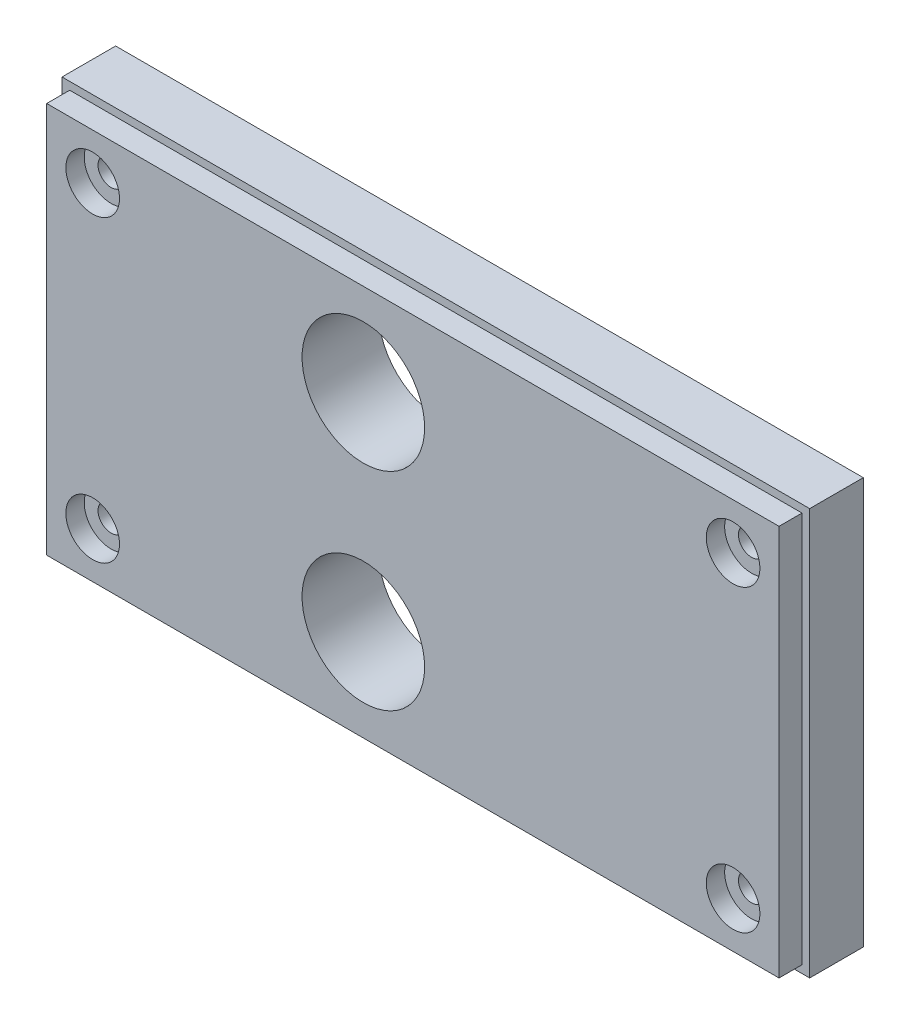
ISO-10303-21;
HEADER;
FILE_DESCRIPTION(('STEP AP214'),'2;1');
FILE_NAME('part.step','',(''),(''),'','','');
FILE_SCHEMA(('AUTOMOTIVE_DESIGN { 1 0 10303 214 1 1 1 1 }'));
ENDSEC;
DATA;
#1=APPLICATION_CONTEXT('core data for automotive mechanical design processes');
#2=APPLICATION_PROTOCOL_DEFINITION('international standard','automotive_design',2000,#1);
#3=PRODUCT_CONTEXT('',#1,'mechanical');
#4=PRODUCT('Part','Part','',(#3));
#5=PRODUCT_RELATED_PRODUCT_CATEGORY('part','',(#4));
#6=PRODUCT_DEFINITION_FORMATION('','',#4);
#7=PRODUCT_DEFINITION_CONTEXT('part definition',#1,'design');
#8=PRODUCT_DEFINITION('design','',#6,#7);
#9=PRODUCT_DEFINITION_SHAPE('','',#8);
#10=(LENGTH_UNIT() NAMED_UNIT(*) SI_UNIT(.MILLI.,.METRE.));
#11=(NAMED_UNIT(*) PLANE_ANGLE_UNIT() SI_UNIT($,.RADIAN.));
#12=(NAMED_UNIT(*) SI_UNIT($,.STERADIAN.) SOLID_ANGLE_UNIT());
#13=UNCERTAINTY_MEASURE_WITH_UNIT(LENGTH_MEASURE(1.E-05),#10,'distance_accuracy_value','');
#14=(GEOMETRIC_REPRESENTATION_CONTEXT(3) GLOBAL_UNCERTAINTY_ASSIGNED_CONTEXT((#13)) GLOBAL_UNIT_ASSIGNED_CONTEXT((#10,
#11,#12)) REPRESENTATION_CONTEXT('',''));
#15=CARTESIAN_POINT('',(0.,0.,0.));
#16=DIRECTION('',(0.,0.,1.));
#17=DIRECTION('',(1.,0.,0.));
#18=AXIS2_PLACEMENT_3D('',#15,#16,#17);
#19=CARTESIAN_POINT('',(0.,0.,7.));
#20=DIRECTION('',(0.,0.,1.));
#21=DIRECTION('',(1.,0.,0.));
#22=AXIS2_PLACEMENT_3D('',#19,#20,#21);
#23=PLANE('',#22);
#24=DIRECTION('',(0.,1.,0.));
#25=VECTOR('',#24,1.);
#26=CARTESIAN_POINT('',(130.,-76.5358983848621,7.));
#27=LINE('',#26,#25);
#28=CARTESIAN_POINT('',(130.,-76.5358983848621,7.));
#29=VERTEX_POINT('',#28);
#30=CARTESIAN_POINT('',(130.,-23.4641016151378,7.));
#31=VERTEX_POINT('',#30);
#32=EDGE_CURVE('E140',#29,#31,#27,.T.);
#33=ORIENTED_EDGE('',*,*,#32,.T.);
#34=DIRECTION('',(-1.,0.,0.));
#35=VECTOR('',#34,1.);
#36=CARTESIAN_POINT('',(130.,-23.4641016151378,7.));
#37=LINE('',#36,#35);
#38=CARTESIAN_POINT('',(32.3904332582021,-23.4641016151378,7.));
#39=VERTEX_POINT('',#38);
#40=EDGE_CURVE('E85',#31,#39,#37,.T.);
#41=ORIENTED_EDGE('',*,*,#40,.T.);
#42=DIRECTION('',(0.,-1.,0.));
#43=VECTOR('',#42,1.);
#44=CARTESIAN_POINT('',(32.3904332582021,-76.5358983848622,7.));
#45=LINE('',#44,#43);
#46=CARTESIAN_POINT('',(32.3904332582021,-76.5358983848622,7.));
#47=VERTEX_POINT('',#46);
#48=EDGE_CURVE('E143',#39,#47,#45,.T.);
#49=ORIENTED_EDGE('',*,*,#48,.T.);
#50=DIRECTION('',(1.,0.,0.));
#51=VECTOR('',#50,1.);
#52=CARTESIAN_POINT('',(130.,-76.5358983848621,7.));
#53=LINE('',#52,#51);
#54=EDGE_CURVE('E57',#47,#29,#53,.T.);
#55=ORIENTED_EDGE('',*,*,#54,.T.);
#56=EDGE_LOOP('',(#33,#41,#49,#55));
#57=FACE_BOUND('',#56,.T.);
#58=DIRECTION('',(1.,0.,0.));
#59=VECTOR('',#58,1.);
#60=CARTESIAN_POINT('',(33.3904332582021,-75.5358983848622,7.));
#61=LINE('',#60,#59);
#62=CARTESIAN_POINT('',(33.3904332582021,-75.5358983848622,7.));
#63=VERTEX_POINT('',#62);
#64=CARTESIAN_POINT('',(129.,-75.5358983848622,7.));
#65=VERTEX_POINT('',#64);
#66=EDGE_CURVE('E322',#63,#65,#61,.T.);
#67=ORIENTED_EDGE('',*,*,#66,.F.);
#68=DIRECTION('',(0.,-1.,0.));
#69=VECTOR('',#68,1.);
#70=CARTESIAN_POINT('',(33.3904332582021,-24.4641016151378,7.));
#71=LINE('',#70,#69);
#72=CARTESIAN_POINT('',(33.3904332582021,-24.4641016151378,7.));
#73=VERTEX_POINT('',#72);
#74=EDGE_CURVE('E130',#73,#63,#71,.T.);
#75=ORIENTED_EDGE('',*,*,#74,.F.);
#76=DIRECTION('',(-1.,0.,0.));
#77=VECTOR('',#76,1.);
#78=CARTESIAN_POINT('',(33.3904332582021,-24.4641016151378,7.));
#79=LINE('',#78,#77);
#80=CARTESIAN_POINT('',(129.,-24.4641016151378,7.));
#81=VERTEX_POINT('',#80);
#82=EDGE_CURVE('E126',#81,#73,#79,.T.);
#83=ORIENTED_EDGE('',*,*,#82,.F.);
#84=DIRECTION('',(0.,1.,0.));
#85=VECTOR('',#84,1.);
#86=CARTESIAN_POINT('',(129.,-24.4641016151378,7.));
#87=LINE('',#86,#85);
#88=EDGE_CURVE('E324',#65,#81,#87,.T.);
#89=ORIENTED_EDGE('',*,*,#88,.F.);
#90=EDGE_LOOP('',(#67,#75,#83,#89));
#91=FACE_BOUND('',#90,.T.);
#92=ADVANCED_FACE('F33',(#57,#91),#23,.T.);
#93=CARTESIAN_POINT('',(130.,-76.5358983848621,7.));
#94=DIRECTION('',(-1.,0.,0.));
#95=DIRECTION('',(0.,0.,1.));
#96=AXIS2_PLACEMENT_3D('',#93,#94,#95);
#97=PLANE('',#96);
#98=DIRECTION('',(0.,1.,0.));
#99=VECTOR('',#98,1.);
#100=CARTESIAN_POINT('',(130.,-76.5358983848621,0.));
#101=LINE('',#100,#99);
#102=CARTESIAN_POINT('',(130.,-76.5358983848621,0.));
#103=VERTEX_POINT('',#102);
#104=CARTESIAN_POINT('',(130.,-23.4641016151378,0.));
#105=VERTEX_POINT('',#104);
#106=EDGE_CURVE('E132',#103,#105,#101,.T.);
#107=ORIENTED_EDGE('',*,*,#106,.T.);
#108=DIRECTION('',(0.,0.,-1.));
#109=VECTOR('',#108,1.);
#110=CARTESIAN_POINT('',(130.,-23.4641016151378,7.));
#111=LINE('',#110,#109);
#112=EDGE_CURVE('E11',#31,#105,#111,.T.);
#113=ORIENTED_EDGE('',*,*,#112,.F.);
#114=ORIENTED_EDGE('',*,*,#32,.F.);
#115=DIRECTION('',(0.,0.,-1.));
#116=VECTOR('',#115,1.);
#117=CARTESIAN_POINT('',(130.,-76.5358983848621,7.));
#118=LINE('',#117,#116);
#119=EDGE_CURVE('E145',#29,#103,#118,.T.);
#120=ORIENTED_EDGE('',*,*,#119,.T.);
#121=EDGE_LOOP('',(#107,#113,#114,#120));
#122=FACE_BOUND('',#121,.T.);
#123=ADVANCED_FACE('F35',(#122),#97,.F.);
#124=CARTESIAN_POINT('',(130.,-23.4641016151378,7.));
#125=DIRECTION('',(0.,-1.,0.));
#126=DIRECTION('',(1.,0.,0.));
#127=AXIS2_PLACEMENT_3D('',#124,#125,#126);
#128=PLANE('',#127);
#129=DIRECTION('',(-1.,0.,0.));
#130=VECTOR('',#129,1.);
#131=CARTESIAN_POINT('',(130.,-23.4641016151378,0.));
#132=LINE('',#131,#130);
#133=CARTESIAN_POINT('',(32.3904332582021,-23.4641016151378,0.));
#134=VERTEX_POINT('',#133);
#135=EDGE_CURVE('E135',#105,#134,#132,.T.);
#136=ORIENTED_EDGE('',*,*,#135,.T.);
#137=DIRECTION('',(0.,0.,-1.));
#138=VECTOR('',#137,1.);
#139=CARTESIAN_POINT('',(32.3904332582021,-23.4641016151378,7.));
#140=LINE('',#139,#138);
#141=EDGE_CURVE('E41',#39,#134,#140,.T.);
#142=ORIENTED_EDGE('',*,*,#141,.F.);
#143=ORIENTED_EDGE('',*,*,#40,.F.);
#144=ORIENTED_EDGE('',*,*,#112,.T.);
#145=EDGE_LOOP('',(#136,#142,#143,#144));
#146=FACE_BOUND('',#145,.T.);
#147=ADVANCED_FACE('F174',(#146),#128,.F.);
#148=CARTESIAN_POINT('',(32.3904332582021,-76.5358983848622,7.));
#149=DIRECTION('',(1.,0.,0.));
#150=DIRECTION('',(0.,0.,-1.));
#151=AXIS2_PLACEMENT_3D('',#148,#149,#150);
#152=PLANE('',#151);
#153=DIRECTION('',(0.,-1.,0.));
#154=VECTOR('',#153,1.);
#155=CARTESIAN_POINT('',(32.3904332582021,-76.5358983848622,0.));
#156=LINE('',#155,#154);
#157=CARTESIAN_POINT('',(32.3904332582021,-76.5358983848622,0.));
#158=VERTEX_POINT('',#157);
#159=EDGE_CURVE('E148',#134,#158,#156,.T.);
#160=ORIENTED_EDGE('',*,*,#159,.T.);
#161=DIRECTION('',(0.,0.,-1.));
#162=VECTOR('',#161,1.);
#163=CARTESIAN_POINT('',(32.3904332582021,-76.5358983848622,7.));
#164=LINE('',#163,#162);
#165=EDGE_CURVE('E152',#47,#158,#164,.T.);
#166=ORIENTED_EDGE('',*,*,#165,.F.);
#167=ORIENTED_EDGE('',*,*,#48,.F.);
#168=ORIENTED_EDGE('',*,*,#141,.T.);
#169=EDGE_LOOP('',(#160,#166,#167,#168));
#170=FACE_BOUND('',#169,.T.);
#171=ADVANCED_FACE('F157',(#170),#152,.F.);
#172=CARTESIAN_POINT('',(130.,-76.5358983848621,7.));
#173=DIRECTION('',(0.,1.,0.));
#174=DIRECTION('',(-1.,0.,0.));
#175=AXIS2_PLACEMENT_3D('',#172,#173,#174);
#176=PLANE('',#175);
#177=DIRECTION('',(1.,0.,0.));
#178=VECTOR('',#177,1.);
#179=CARTESIAN_POINT('',(130.,-76.5358983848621,0.));
#180=LINE('',#179,#178);
#181=EDGE_CURVE('E78',#158,#103,#180,.T.);
#182=ORIENTED_EDGE('',*,*,#181,.T.);
#183=ORIENTED_EDGE('',*,*,#119,.F.);
#184=ORIENTED_EDGE('',*,*,#54,.F.);
#185=ORIENTED_EDGE('',*,*,#165,.T.);
#186=EDGE_LOOP('',(#182,#183,#184,#185));
#187=FACE_BOUND('',#186,.T.);
#188=ADVANCED_FACE('F165',(#187),#176,.F.);
#189=CARTESIAN_POINT('',(0.,0.,0.));
#190=DIRECTION('',(0.,0.,1.));
#191=DIRECTION('',(1.,0.,0.));
#192=AXIS2_PLACEMENT_3D('',#189,#190,#191);
#193=PLANE('',#192);
#194=CARTESIAN_POINT('',(74.7285789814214,-63.5358983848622,0.));
#195=DIRECTION('',(0.,0.,1.));
#196=DIRECTION('',(1.,0.,0.));
#197=AXIS2_PLACEMENT_3D('',#194,#195,#196);
#198=CIRCLE('',#197,8.00000000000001);
#199=CARTESIAN_POINT('',(82.7285789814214,-63.5358983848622,0.));
#200=VERTEX_POINT('',#199);
#201=EDGE_CURVE('E260',#200,#200,#198,.F.);
#202=ORIENTED_EDGE('',*,*,#201,.F.);
#203=EDGE_LOOP('',(#202));
#204=FACE_BOUND('',#203,.T.);
#205=CARTESIAN_POINT('',(74.7285789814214,-36.4641016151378,0.));
#206=DIRECTION('',(0.,0.,1.));
#207=DIRECTION('',(1.,0.,0.));
#208=AXIS2_PLACEMENT_3D('',#205,#206,#207);
#209=CIRCLE('',#208,8.00000000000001);
#210=CARTESIAN_POINT('',(82.7285789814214,-36.4641016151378,0.));
#211=VERTEX_POINT('',#210);
#212=EDGE_CURVE('E264',#211,#211,#209,.F.);
#213=ORIENTED_EDGE('',*,*,#212,.F.);
#214=EDGE_LOOP('',(#213));
#215=FACE_BOUND('',#214,.T.);
#216=CARTESIAN_POINT('',(123.,-30.4641016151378,0.));
#217=DIRECTION('',(0.,0.,1.));
#218=DIRECTION('',(1.,0.,0.));
#219=AXIS2_PLACEMENT_3D('',#216,#217,#218);
#220=CIRCLE('',#219,1.7);
#221=CARTESIAN_POINT('',(124.7,-30.4641016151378,0.));
#222=VERTEX_POINT('',#221);
#223=EDGE_CURVE('E279',#222,#222,#220,.T.);
#224=ORIENTED_EDGE('',*,*,#223,.T.);
#225=EDGE_LOOP('',(#224));
#226=FACE_BOUND('',#225,.T.);
#227=CARTESIAN_POINT('',(123.,-69.5358983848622,0.));
#228=DIRECTION('',(0.,0.,1.));
#229=DIRECTION('',(1.,0.,0.));
#230=AXIS2_PLACEMENT_3D('',#227,#228,#229);
#231=CIRCLE('',#230,1.7);
#232=CARTESIAN_POINT('',(124.7,-69.5358983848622,0.));
#233=VERTEX_POINT('',#232);
#234=EDGE_CURVE('E291',#233,#233,#231,.T.);
#235=ORIENTED_EDGE('',*,*,#234,.T.);
#236=EDGE_LOOP('',(#235));
#237=FACE_BOUND('',#236,.T.);
#238=CARTESIAN_POINT('',(39.3904332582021,-69.5358983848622,0.));
#239=DIRECTION('',(0.,0.,1.));
#240=DIRECTION('',(1.,0.,0.));
#241=AXIS2_PLACEMENT_3D('',#238,#239,#240);
#242=CIRCLE('',#241,1.7);
#243=CARTESIAN_POINT('',(41.0904332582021,-69.5358983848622,0.));
#244=VERTEX_POINT('',#243);
#245=EDGE_CURVE('E303',#244,#244,#242,.T.);
#246=ORIENTED_EDGE('',*,*,#245,.T.);
#247=EDGE_LOOP('',(#246));
#248=FACE_BOUND('',#247,.T.);
#249=CARTESIAN_POINT('',(39.3904332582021,-30.4641016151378,0.));
#250=DIRECTION('',(0.,0.,1.));
#251=DIRECTION('',(1.,0.,0.));
#252=AXIS2_PLACEMENT_3D('',#249,#250,#251);
#253=CIRCLE('',#252,1.7);
#254=CARTESIAN_POINT('',(41.0904332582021,-30.4641016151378,0.));
#255=VERTEX_POINT('',#254);
#256=EDGE_CURVE('E315',#255,#255,#253,.T.);
#257=ORIENTED_EDGE('',*,*,#256,.T.);
#258=EDGE_LOOP('',(#257));
#259=FACE_BOUND('',#258,.T.);
#260=ORIENTED_EDGE('',*,*,#106,.F.);
#261=ORIENTED_EDGE('',*,*,#181,.F.);
#262=ORIENTED_EDGE('',*,*,#159,.F.);
#263=ORIENTED_EDGE('',*,*,#135,.F.);
#264=EDGE_LOOP('',(#260,#261,#262,#263));
#265=FACE_BOUND('',#264,.T.);
#266=ADVANCED_FACE('F161',(#204,#215,#226,#237,#248,#259,#265),#193,.F.);
#267=CARTESIAN_POINT('',(33.3904332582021,-24.4641016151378,10.));
#268=DIRECTION('',(1.,0.,0.));
#269=DIRECTION('',(0.,1.,0.));
#270=AXIS2_PLACEMENT_3D('',#267,#268,#269);
#271=PLANE('',#270);
#272=ORIENTED_EDGE('',*,*,#74,.T.);
#273=DIRECTION('',(0.,0.,-1.));
#274=VECTOR('',#273,1.);
#275=CARTESIAN_POINT('',(33.3904332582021,-75.5358983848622,10.));
#276=LINE('',#275,#274);
#277=CARTESIAN_POINT('',(33.3904332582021,-75.5358983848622,10.));
#278=VERTEX_POINT('',#277);
#279=EDGE_CURVE('E111',#278,#63,#276,.T.);
#280=ORIENTED_EDGE('',*,*,#279,.F.);
#281=DIRECTION('',(0.,-1.,0.));
#282=VECTOR('',#281,1.);
#283=CARTESIAN_POINT('',(33.3904332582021,-24.4641016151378,10.));
#284=LINE('',#283,#282);
#285=CARTESIAN_POINT('',(33.3904332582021,-24.4641016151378,10.));
#286=VERTEX_POINT('',#285);
#287=EDGE_CURVE('E118',#286,#278,#284,.T.);
#288=ORIENTED_EDGE('',*,*,#287,.F.);
#289=DIRECTION('',(0.,0.,-1.));
#290=VECTOR('',#289,1.);
#291=CARTESIAN_POINT('',(33.3904332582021,-24.4641016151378,10.));
#292=LINE('',#291,#290);
#293=EDGE_CURVE('E320',#286,#73,#292,.T.);
#294=ORIENTED_EDGE('',*,*,#293,.T.);
#295=EDGE_LOOP('',(#272,#280,#288,#294));
#296=FACE_BOUND('',#295,.T.);
#297=ADVANCED_FACE('F128',(#296),#271,.F.);
#298=CARTESIAN_POINT('',(33.3904332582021,-75.5358983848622,10.));
#299=DIRECTION('',(0.,1.,0.));
#300=DIRECTION('',(0.,0.,1.));
#301=AXIS2_PLACEMENT_3D('',#298,#299,#300);
#302=PLANE('',#301);
#303=ORIENTED_EDGE('',*,*,#66,.T.);
#304=DIRECTION('',(0.,0.,-1.));
#305=VECTOR('',#304,1.);
#306=CARTESIAN_POINT('',(129.,-75.5358983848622,10.));
#307=LINE('',#306,#305);
#308=CARTESIAN_POINT('',(129.,-75.5358983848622,10.));
#309=VERTEX_POINT('',#308);
#310=EDGE_CURVE('E114',#309,#65,#307,.T.);
#311=ORIENTED_EDGE('',*,*,#310,.F.);
#312=DIRECTION('',(1.,0.,0.));
#313=VECTOR('',#312,1.);
#314=CARTESIAN_POINT('',(33.3904332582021,-75.5358983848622,10.));
#315=LINE('',#314,#313);
#316=EDGE_CURVE('E107',#278,#309,#315,.T.);
#317=ORIENTED_EDGE('',*,*,#316,.F.);
#318=ORIENTED_EDGE('',*,*,#279,.T.);
#319=EDGE_LOOP('',(#303,#311,#317,#318));
#320=FACE_BOUND('',#319,.T.);
#321=ADVANCED_FACE('F109',(#320),#302,.F.);
#322=CARTESIAN_POINT('',(129.,-24.4641016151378,10.));
#323=DIRECTION('',(-1.,0.,0.));
#324=DIRECTION('',(0.,0.,1.));
#325=AXIS2_PLACEMENT_3D('',#322,#323,#324);
#326=PLANE('',#325);
#327=ORIENTED_EDGE('',*,*,#88,.T.);
#328=DIRECTION('',(0.,0.,-1.));
#329=VECTOR('',#328,1.);
#330=CARTESIAN_POINT('',(129.,-24.4641016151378,10.));
#331=LINE('',#330,#329);
#332=CARTESIAN_POINT('',(129.,-24.4641016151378,10.));
#333=VERTEX_POINT('',#332);
#334=EDGE_CURVE('E48',#333,#81,#331,.T.);
#335=ORIENTED_EDGE('',*,*,#334,.F.);
#336=DIRECTION('',(0.,1.,0.));
#337=VECTOR('',#336,1.);
#338=CARTESIAN_POINT('',(129.,-24.4641016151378,10.));
#339=LINE('',#338,#337);
#340=EDGE_CURVE('E117',#309,#333,#339,.T.);
#341=ORIENTED_EDGE('',*,*,#340,.F.);
#342=ORIENTED_EDGE('',*,*,#310,.T.);
#343=EDGE_LOOP('',(#327,#335,#341,#342));
#344=FACE_BOUND('',#343,.T.);
#345=ADVANCED_FACE('F187',(#344),#326,.F.);
#346=CARTESIAN_POINT('',(33.3904332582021,-24.4641016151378,10.));
#347=DIRECTION('',(0.,-1.,0.));
#348=DIRECTION('',(0.,0.,-1.));
#349=AXIS2_PLACEMENT_3D('',#346,#347,#348);
#350=PLANE('',#349);
#351=ORIENTED_EDGE('',*,*,#82,.T.);
#352=ORIENTED_EDGE('',*,*,#293,.F.);
#353=DIRECTION('',(-1.,0.,0.));
#354=VECTOR('',#353,1.);
#355=CARTESIAN_POINT('',(33.3904332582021,-24.4641016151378,10.));
#356=LINE('',#355,#354);
#357=EDGE_CURVE('E122',#333,#286,#356,.T.);
#358=ORIENTED_EDGE('',*,*,#357,.F.);
#359=ORIENTED_EDGE('',*,*,#334,.T.);
#360=EDGE_LOOP('',(#351,#352,#358,#359));
#361=FACE_BOUND('',#360,.T.);
#362=ADVANCED_FACE('F190',(#361),#350,.F.);
#363=CARTESIAN_POINT('',(0.,0.,10.));
#364=DIRECTION('',(0.,0.,1.));
#365=DIRECTION('',(1.,0.,0.));
#366=AXIS2_PLACEMENT_3D('',#363,#364,#365);
#367=PLANE('',#366);
#368=CARTESIAN_POINT('',(74.7285789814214,-63.5358983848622,10.));
#369=DIRECTION('',(0.,0.,1.));
#370=DIRECTION('',(1.,0.,0.));
#371=AXIS2_PLACEMENT_3D('',#368,#369,#370);
#372=CIRCLE('',#371,8.00000000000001);
#373=CARTESIAN_POINT('',(82.7285789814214,-63.5358983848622,10.));
#374=VERTEX_POINT('',#373);
#375=EDGE_CURVE('E257',#374,#374,#372,.T.);
#376=ORIENTED_EDGE('',*,*,#375,.F.);
#377=EDGE_LOOP('',(#376));
#378=FACE_BOUND('',#377,.T.);
#379=CARTESIAN_POINT('',(74.7285789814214,-36.4641016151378,10.));
#380=DIRECTION('',(0.,0.,1.));
#381=DIRECTION('',(1.,0.,0.));
#382=AXIS2_PLACEMENT_3D('',#379,#380,#381);
#383=CIRCLE('',#382,8.00000000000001);
#384=CARTESIAN_POINT('',(82.7285789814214,-36.4641016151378,10.));
#385=VERTEX_POINT('',#384);
#386=EDGE_CURVE('E261',#385,#385,#383,.T.);
#387=ORIENTED_EDGE('',*,*,#386,.F.);
#388=EDGE_LOOP('',(#387));
#389=FACE_BOUND('',#388,.T.);
#390=CARTESIAN_POINT('',(123.,-30.4641016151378,10.));
#391=DIRECTION('',(0.,0.,1.));
#392=DIRECTION('',(1.,0.,0.));
#393=AXIS2_PLACEMENT_3D('',#390,#391,#392);
#394=CIRCLE('',#393,3.5);
#395=CARTESIAN_POINT('',(126.5,-30.4641016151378,10.));
#396=VERTEX_POINT('',#395);
#397=EDGE_CURVE('E270',#396,#396,#394,.T.);
#398=ORIENTED_EDGE('',*,*,#397,.F.);
#399=EDGE_LOOP('',(#398));
#400=FACE_BOUND('',#399,.T.);
#401=CARTESIAN_POINT('',(123.,-69.5358983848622,10.));
#402=DIRECTION('',(0.,0.,1.));
#403=DIRECTION('',(1.,0.,0.));
#404=AXIS2_PLACEMENT_3D('',#401,#402,#403);
#405=CIRCLE('',#404,3.5);
#406=CARTESIAN_POINT('',(126.5,-69.5358983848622,10.));
#407=VERTEX_POINT('',#406);
#408=EDGE_CURVE('E282',#407,#407,#405,.T.);
#409=ORIENTED_EDGE('',*,*,#408,.F.);
#410=EDGE_LOOP('',(#409));
#411=FACE_BOUND('',#410,.T.);
#412=CARTESIAN_POINT('',(39.3904332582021,-69.5358983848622,10.));
#413=DIRECTION('',(0.,0.,1.));
#414=DIRECTION('',(1.,0.,0.));
#415=AXIS2_PLACEMENT_3D('',#412,#413,#414);
#416=CIRCLE('',#415,3.5);
#417=CARTESIAN_POINT('',(42.8904332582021,-69.5358983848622,10.));
#418=VERTEX_POINT('',#417);
#419=EDGE_CURVE('E294',#418,#418,#416,.T.);
#420=ORIENTED_EDGE('',*,*,#419,.F.);
#421=EDGE_LOOP('',(#420));
#422=FACE_BOUND('',#421,.T.);
#423=CARTESIAN_POINT('',(39.3904332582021,-30.4641016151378,10.));
#424=DIRECTION('',(0.,0.,1.));
#425=DIRECTION('',(1.,0.,0.));
#426=AXIS2_PLACEMENT_3D('',#423,#424,#425);
#427=CIRCLE('',#426,3.5);
#428=CARTESIAN_POINT('',(42.8904332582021,-30.4641016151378,10.));
#429=VERTEX_POINT('',#428);
#430=EDGE_CURVE('E306',#429,#429,#427,.T.);
#431=ORIENTED_EDGE('',*,*,#430,.F.);
#432=EDGE_LOOP('',(#431));
#433=FACE_BOUND('',#432,.T.);
#434=ORIENTED_EDGE('',*,*,#287,.T.);
#435=ORIENTED_EDGE('',*,*,#316,.T.);
#436=ORIENTED_EDGE('',*,*,#340,.T.);
#437=ORIENTED_EDGE('',*,*,#357,.T.);
#438=EDGE_LOOP('',(#434,#435,#436,#437));
#439=FACE_BOUND('',#438,.T.);
#440=ADVANCED_FACE('F121',(#378,#389,#400,#411,#422,#433,#439),#367,.T.);
#441=CARTESIAN_POINT('',(39.3904332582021,-30.4641016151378,10.));
#442=DIRECTION('',(0.,0.,1.));
#443=DIRECTION('',(1.,0.,0.));
#444=AXIS2_PLACEMENT_3D('',#441,#442,#443);
#445=CYLINDRICAL_SURFACE('',#444,1.7);
#446=ORIENTED_EDGE('',*,*,#256,.F.);
#447=EDGE_LOOP('',(#446));
#448=FACE_BOUND('',#447,.T.);
#449=CARTESIAN_POINT('',(39.3904332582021,-30.4641016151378,7.6));
#450=DIRECTION('',(0.,0.,1.));
#451=DIRECTION('',(1.,0.,0.));
#452=AXIS2_PLACEMENT_3D('',#449,#450,#451);
#453=CIRCLE('',#452,1.70000000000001);
#454=CARTESIAN_POINT('',(41.0904332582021,-30.4641016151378,7.6));
#455=VERTEX_POINT('',#454);
#456=EDGE_CURVE('E312',#455,#455,#453,.T.);
#457=ORIENTED_EDGE('',*,*,#456,.T.);
#458=EDGE_LOOP('',(#457));
#459=FACE_BOUND('',#458,.T.);
#460=ADVANCED_FACE('F196',(#448,#459),#445,.F.);
#461=CARTESIAN_POINT('',(41.0904332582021,-30.4641016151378,7.6));
#462=DIRECTION('',(0.,0.,-1.));
#463=DIRECTION('',(-1.,0.,0.));
#464=AXIS2_PLACEMENT_3D('',#461,#462,#463);
#465=PLANE('',#464);
#466=ORIENTED_EDGE('',*,*,#456,.F.);
#467=EDGE_LOOP('',(#466));
#468=FACE_BOUND('',#467,.T.);
#469=CARTESIAN_POINT('',(39.3904332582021,-30.4641016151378,7.6));
#470=DIRECTION('',(0.,0.,1.));
#471=DIRECTION('',(1.,0.,0.));
#472=AXIS2_PLACEMENT_3D('',#469,#470,#471);
#473=CIRCLE('',#472,3.5);
#474=CARTESIAN_POINT('',(42.8904332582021,-30.4641016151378,7.6));
#475=VERTEX_POINT('',#474);
#476=EDGE_CURVE('E309',#475,#475,#473,.T.);
#477=ORIENTED_EDGE('',*,*,#476,.T.);
#478=EDGE_LOOP('',(#477));
#479=FACE_BOUND('',#478,.T.);
#480=ADVANCED_FACE('F200',(#468,#479),#465,.F.);
#481=CARTESIAN_POINT('',(39.3904332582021,-30.4641016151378,10.));
#482=DIRECTION('',(0.,0.,1.));
#483=DIRECTION('',(1.,0.,0.));
#484=AXIS2_PLACEMENT_3D('',#481,#482,#483);
#485=CYLINDRICAL_SURFACE('',#484,3.5);
#486=ORIENTED_EDGE('',*,*,#476,.F.);
#487=EDGE_LOOP('',(#486));
#488=FACE_BOUND('',#487,.T.);
#489=ORIENTED_EDGE('',*,*,#430,.T.);
#490=EDGE_LOOP('',(#489));
#491=FACE_BOUND('',#490,.T.);
#492=ADVANCED_FACE('F204',(#488,#491),#485,.F.);
#493=CARTESIAN_POINT('',(39.3904332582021,-69.5358983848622,10.));
#494=DIRECTION('',(0.,0.,1.));
#495=DIRECTION('',(1.,0.,0.));
#496=AXIS2_PLACEMENT_3D('',#493,#494,#495);
#497=CYLINDRICAL_SURFACE('',#496,1.7);
#498=ORIENTED_EDGE('',*,*,#245,.F.);
#499=EDGE_LOOP('',(#498));
#500=FACE_BOUND('',#499,.T.);
#501=CARTESIAN_POINT('',(39.3904332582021,-69.5358983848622,7.6));
#502=DIRECTION('',(0.,0.,1.));
#503=DIRECTION('',(1.,0.,0.));
#504=AXIS2_PLACEMENT_3D('',#501,#502,#503);
#505=CIRCLE('',#504,1.70000000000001);
#506=CARTESIAN_POINT('',(41.0904332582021,-69.5358983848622,7.6));
#507=VERTEX_POINT('',#506);
#508=EDGE_CURVE('E300',#507,#507,#505,.T.);
#509=ORIENTED_EDGE('',*,*,#508,.T.);
#510=EDGE_LOOP('',(#509));
#511=FACE_BOUND('',#510,.T.);
#512=ADVANCED_FACE('F208',(#500,#511),#497,.F.);
#513=CARTESIAN_POINT('',(41.0904332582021,-69.5358983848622,7.6));
#514=DIRECTION('',(0.,0.,-1.));
#515=DIRECTION('',(-1.,0.,0.));
#516=AXIS2_PLACEMENT_3D('',#513,#514,#515);
#517=PLANE('',#516);
#518=ORIENTED_EDGE('',*,*,#508,.F.);
#519=EDGE_LOOP('',(#518));
#520=FACE_BOUND('',#519,.T.);
#521=CARTESIAN_POINT('',(39.3904332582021,-69.5358983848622,7.6));
#522=DIRECTION('',(0.,0.,1.));
#523=DIRECTION('',(1.,0.,0.));
#524=AXIS2_PLACEMENT_3D('',#521,#522,#523);
#525=CIRCLE('',#524,3.5);
#526=CARTESIAN_POINT('',(42.8904332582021,-69.5358983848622,7.6));
#527=VERTEX_POINT('',#526);
#528=EDGE_CURVE('E297',#527,#527,#525,.T.);
#529=ORIENTED_EDGE('',*,*,#528,.T.);
#530=EDGE_LOOP('',(#529));
#531=FACE_BOUND('',#530,.T.);
#532=ADVANCED_FACE('F212',(#520,#531),#517,.F.);
#533=CARTESIAN_POINT('',(39.3904332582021,-69.5358983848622,10.));
#534=DIRECTION('',(0.,0.,1.));
#535=DIRECTION('',(1.,0.,0.));
#536=AXIS2_PLACEMENT_3D('',#533,#534,#535);
#537=CYLINDRICAL_SURFACE('',#536,3.5);
#538=ORIENTED_EDGE('',*,*,#528,.F.);
#539=EDGE_LOOP('',(#538));
#540=FACE_BOUND('',#539,.T.);
#541=ORIENTED_EDGE('',*,*,#419,.T.);
#542=EDGE_LOOP('',(#541));
#543=FACE_BOUND('',#542,.T.);
#544=ADVANCED_FACE('F216',(#540,#543),#537,.F.);
#545=CARTESIAN_POINT('',(123.,-69.5358983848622,10.));
#546=DIRECTION('',(0.,0.,1.));
#547=DIRECTION('',(1.,0.,0.));
#548=AXIS2_PLACEMENT_3D('',#545,#546,#547);
#549=CYLINDRICAL_SURFACE('',#548,1.7);
#550=ORIENTED_EDGE('',*,*,#234,.F.);
#551=EDGE_LOOP('',(#550));
#552=FACE_BOUND('',#551,.T.);
#553=CARTESIAN_POINT('',(123.,-69.5358983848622,7.6));
#554=DIRECTION('',(0.,0.,1.));
#555=DIRECTION('',(1.,0.,0.));
#556=AXIS2_PLACEMENT_3D('',#553,#554,#555);
#557=CIRCLE('',#556,1.70000000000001);
#558=CARTESIAN_POINT('',(124.7,-69.5358983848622,7.6));
#559=VERTEX_POINT('',#558);
#560=EDGE_CURVE('E288',#559,#559,#557,.T.);
#561=ORIENTED_EDGE('',*,*,#560,.T.);
#562=EDGE_LOOP('',(#561));
#563=FACE_BOUND('',#562,.T.);
#564=ADVANCED_FACE('F220',(#552,#563),#549,.F.);
#565=CARTESIAN_POINT('',(124.7,-69.5358983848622,7.6));
#566=DIRECTION('',(0.,0.,-1.));
#567=DIRECTION('',(-1.,0.,0.));
#568=AXIS2_PLACEMENT_3D('',#565,#566,#567);
#569=PLANE('',#568);
#570=ORIENTED_EDGE('',*,*,#560,.F.);
#571=EDGE_LOOP('',(#570));
#572=FACE_BOUND('',#571,.T.);
#573=CARTESIAN_POINT('',(123.,-69.5358983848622,7.6));
#574=DIRECTION('',(0.,0.,1.));
#575=DIRECTION('',(1.,0.,0.));
#576=AXIS2_PLACEMENT_3D('',#573,#574,#575);
#577=CIRCLE('',#576,3.5);
#578=CARTESIAN_POINT('',(126.5,-69.5358983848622,7.6));
#579=VERTEX_POINT('',#578);
#580=EDGE_CURVE('E285',#579,#579,#577,.T.);
#581=ORIENTED_EDGE('',*,*,#580,.T.);
#582=EDGE_LOOP('',(#581));
#583=FACE_BOUND('',#582,.T.);
#584=ADVANCED_FACE('F224',(#572,#583),#569,.F.);
#585=CARTESIAN_POINT('',(123.,-69.5358983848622,10.));
#586=DIRECTION('',(0.,0.,1.));
#587=DIRECTION('',(1.,0.,0.));
#588=AXIS2_PLACEMENT_3D('',#585,#586,#587);
#589=CYLINDRICAL_SURFACE('',#588,3.5);
#590=ORIENTED_EDGE('',*,*,#580,.F.);
#591=EDGE_LOOP('',(#590));
#592=FACE_BOUND('',#591,.T.);
#593=ORIENTED_EDGE('',*,*,#408,.T.);
#594=EDGE_LOOP('',(#593));
#595=FACE_BOUND('',#594,.T.);
#596=ADVANCED_FACE('F228',(#592,#595),#589,.F.);
#597=CARTESIAN_POINT('',(123.,-30.4641016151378,10.));
#598=DIRECTION('',(0.,0.,1.));
#599=DIRECTION('',(1.,0.,0.));
#600=AXIS2_PLACEMENT_3D('',#597,#598,#599);
#601=CYLINDRICAL_SURFACE('',#600,1.7);
#602=ORIENTED_EDGE('',*,*,#223,.F.);
#603=EDGE_LOOP('',(#602));
#604=FACE_BOUND('',#603,.T.);
#605=CARTESIAN_POINT('',(123.,-30.4641016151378,7.6));
#606=DIRECTION('',(0.,0.,1.));
#607=DIRECTION('',(1.,0.,0.));
#608=AXIS2_PLACEMENT_3D('',#605,#606,#607);
#609=CIRCLE('',#608,1.70000000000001);
#610=CARTESIAN_POINT('',(124.7,-30.4641016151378,7.6));
#611=VERTEX_POINT('',#610);
#612=EDGE_CURVE('E276',#611,#611,#609,.T.);
#613=ORIENTED_EDGE('',*,*,#612,.T.);
#614=EDGE_LOOP('',(#613));
#615=FACE_BOUND('',#614,.T.);
#616=ADVANCED_FACE('F232',(#604,#615),#601,.F.);
#617=CARTESIAN_POINT('',(124.7,-30.4641016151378,7.6));
#618=DIRECTION('',(0.,0.,-1.));
#619=DIRECTION('',(-1.,0.,0.));
#620=AXIS2_PLACEMENT_3D('',#617,#618,#619);
#621=PLANE('',#620);
#622=ORIENTED_EDGE('',*,*,#612,.F.);
#623=EDGE_LOOP('',(#622));
#624=FACE_BOUND('',#623,.T.);
#625=CARTESIAN_POINT('',(123.,-30.4641016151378,7.6));
#626=DIRECTION('',(0.,0.,1.));
#627=DIRECTION('',(1.,0.,0.));
#628=AXIS2_PLACEMENT_3D('',#625,#626,#627);
#629=CIRCLE('',#628,3.5);
#630=CARTESIAN_POINT('',(126.5,-30.4641016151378,7.6));
#631=VERTEX_POINT('',#630);
#632=EDGE_CURVE('E273',#631,#631,#629,.T.);
#633=ORIENTED_EDGE('',*,*,#632,.T.);
#634=EDGE_LOOP('',(#633));
#635=FACE_BOUND('',#634,.T.);
#636=ADVANCED_FACE('F236',(#624,#635),#621,.F.);
#637=CARTESIAN_POINT('',(123.,-30.4641016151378,10.));
#638=DIRECTION('',(0.,0.,1.));
#639=DIRECTION('',(1.,0.,0.));
#640=AXIS2_PLACEMENT_3D('',#637,#638,#639);
#641=CYLINDRICAL_SURFACE('',#640,3.5);
#642=ORIENTED_EDGE('',*,*,#632,.F.);
#643=EDGE_LOOP('',(#642));
#644=FACE_BOUND('',#643,.T.);
#645=ORIENTED_EDGE('',*,*,#397,.T.);
#646=EDGE_LOOP('',(#645));
#647=FACE_BOUND('',#646,.T.);
#648=ADVANCED_FACE('F240',(#644,#647),#641,.F.);
#649=CARTESIAN_POINT('',(74.7285789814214,-36.4641016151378,-0.000999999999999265));
#650=DIRECTION('',(0.,0.,1.));
#651=DIRECTION('',(1.,0.,0.));
#652=AXIS2_PLACEMENT_3D('',#649,#650,#651);
#653=CYLINDRICAL_SURFACE('',#652,8.00000000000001);
#654=ORIENTED_EDGE('',*,*,#386,.T.);
#655=EDGE_LOOP('',(#654));
#656=FACE_BOUND('',#655,.T.);
#657=ORIENTED_EDGE('',*,*,#212,.T.);
#658=EDGE_LOOP('',(#657));
#659=FACE_BOUND('',#658,.T.);
#660=ADVANCED_FACE('F244',(#656,#659),#653,.F.);
#661=CARTESIAN_POINT('',(74.7285789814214,-63.5358983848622,-0.000999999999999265));
#662=DIRECTION('',(0.,0.,1.));
#663=DIRECTION('',(1.,0.,0.));
#664=AXIS2_PLACEMENT_3D('',#661,#662,#663);
#665=CYLINDRICAL_SURFACE('',#664,8.00000000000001);
#666=ORIENTED_EDGE('',*,*,#375,.T.);
#667=EDGE_LOOP('',(#666));
#668=FACE_BOUND('',#667,.T.);
#669=ORIENTED_EDGE('',*,*,#201,.T.);
#670=EDGE_LOOP('',(#669));
#671=FACE_BOUND('',#670,.T.);
#672=ADVANCED_FACE('F248',(#668,#671),#665,.F.);
#673=CLOSED_SHELL('',(#92,#123,#147,#171,#188,#266,#297,#321,#345,#362,#440,#460,#480,#492,#512,
#532,#544,#564,#584,#596,#616,#636,#648,#660,#672));
#674=MANIFOLD_SOLID_BREP('B2',#673);
#675=ADVANCED_BREP_SHAPE_REPRESENTATION('',(#18,#674),#14);
#676=SHAPE_DEFINITION_REPRESENTATION(#9,#675);
ENDSEC;
END-ISO-10303-21;
